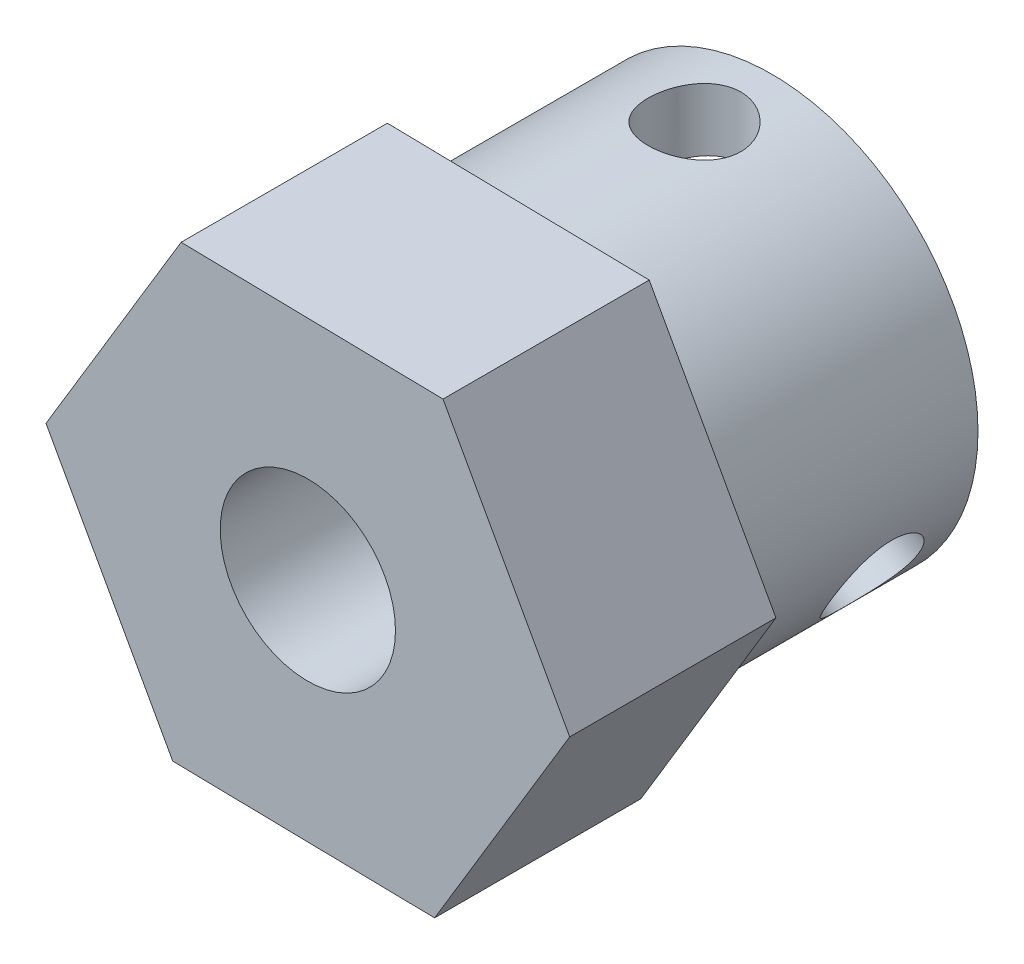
ISO-10303-21;
HEADER;
FILE_DESCRIPTION(('STEP AP214'),'2;1');
FILE_NAME('part.step','',(''),(''),'','','');
FILE_SCHEMA(('AUTOMOTIVE_DESIGN { 1 0 10303 214 1 1 1 1 }'));
ENDSEC;
DATA;
#1=APPLICATION_CONTEXT('core data for automotive mechanical design processes');
#2=APPLICATION_PROTOCOL_DEFINITION('international standard','automotive_design',2000,#1);
#3=PRODUCT_CONTEXT('',#1,'mechanical');
#4=PRODUCT('Part','Part','',(#3));
#5=PRODUCT_RELATED_PRODUCT_CATEGORY('part','',(#4));
#6=PRODUCT_DEFINITION_FORMATION('','',#4);
#7=PRODUCT_DEFINITION_CONTEXT('part definition',#1,'design');
#8=PRODUCT_DEFINITION('design','',#6,#7);
#9=PRODUCT_DEFINITION_SHAPE('','',#8);
#10=(LENGTH_UNIT() NAMED_UNIT(*) SI_UNIT(.MILLI.,.METRE.));
#11=(NAMED_UNIT(*) PLANE_ANGLE_UNIT() SI_UNIT($,.RADIAN.));
#12=(NAMED_UNIT(*) SI_UNIT($,.STERADIAN.) SOLID_ANGLE_UNIT());
#13=UNCERTAINTY_MEASURE_WITH_UNIT(LENGTH_MEASURE(1.E-05),#10,'distance_accuracy_value','');
#14=(GEOMETRIC_REPRESENTATION_CONTEXT(3) GLOBAL_UNCERTAINTY_ASSIGNED_CONTEXT((#13)) GLOBAL_UNIT_ASSIGNED_CONTEXT((#10,
#11,#12)) REPRESENTATION_CONTEXT('',''));
#15=CARTESIAN_POINT('',(0.,0.,0.));
#16=DIRECTION('',(0.,0.,1.));
#17=DIRECTION('',(1.,0.,0.));
#18=AXIS2_PLACEMENT_3D('',#15,#16,#17);
#19=CARTESIAN_POINT('',(0.,0.,-8.89));
#20=DIRECTION('',(0.,0.,1.));
#21=DIRECTION('',(1.,0.,0.));
#22=AXIS2_PLACEMENT_3D('',#19,#20,#21);
#23=CYLINDRICAL_SURFACE('',#22,5.08);
#24=CARTESIAN_POINT('',(3.7151027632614,-3.46473829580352,-6.985));
#25=CARTESIAN_POINT('',(3.71510492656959,-3.4647371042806,-6.92167529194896));
#26=CARTESIAN_POINT('',(3.71880684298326,-3.460779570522,-6.85832558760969));
#27=CARTESIAN_POINT('',(3.73340901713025,-3.44502080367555,-6.73343108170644));
#28=CARTESIAN_POINT('',(3.74431428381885,-3.43321411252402,-6.67188756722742));
#29=CARTESIAN_POINT('',(3.77269797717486,-3.40199815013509,-6.55243010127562));
#30=CARTESIAN_POINT('',(3.79016895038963,-3.38259749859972,-6.49451212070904));
#31=CARTESIAN_POINT('',(3.83077327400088,-3.33654229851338,-6.38378022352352));
#32=CARTESIAN_POINT('',(3.85390657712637,-3.30988781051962,-6.33096626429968));
#33=CARTESIAN_POINT('',(3.9051353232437,-3.24929423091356,-6.2309975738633));
#34=CARTESIAN_POINT('',(3.93330448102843,-3.21524503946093,-6.1839473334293));
#35=CARTESIAN_POINT('',(3.99305813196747,-3.14072661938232,-6.09775782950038));
#36=CARTESIAN_POINT('',(4.02464289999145,-3.10025687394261,-6.05861920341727));
#37=CARTESIAN_POINT('',(4.09024650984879,-3.01318488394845,-5.98894788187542));
#38=CARTESIAN_POINT('',(4.12428858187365,-2.96651924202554,-5.9585161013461));
#39=CARTESIAN_POINT('',(4.1930869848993,-2.86844979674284,-5.90777581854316));
#40=CARTESIAN_POINT('',(4.22784323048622,-2.81704655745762,-5.88746611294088));
#41=CARTESIAN_POINT('',(4.29616501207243,-2.71168608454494,-5.85787629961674));
#42=CARTESIAN_POINT('',(4.32974073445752,-2.65778519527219,-5.84841922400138));
#43=CARTESIAN_POINT('',(4.39515628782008,-2.54815102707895,-5.84024940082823));
#44=CARTESIAN_POINT('',(4.42699632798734,-2.49241797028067,-5.84153535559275));
#45=CARTESIAN_POINT('',(4.48747170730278,-2.38178564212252,-5.85468414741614));
#46=CARTESIAN_POINT('',(4.51615441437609,-2.32688941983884,-5.86635618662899));
#47=CARTESIAN_POINT('',(4.57034313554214,-2.21856570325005,-5.89964127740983));
#48=CARTESIAN_POINT('',(4.5958490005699,-2.16513827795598,-5.92125479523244));
#49=CARTESIAN_POINT('',(4.643499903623,-2.06097483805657,-5.97397529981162));
#50=CARTESIAN_POINT('',(4.66561769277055,-2.01026258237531,-6.00515375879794));
#51=CARTESIAN_POINT('',(4.70611414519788,-1.91354199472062,-6.07606564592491));
#52=CARTESIAN_POINT('',(4.72449227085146,-1.86753433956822,-6.11580030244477));
#53=CARTESIAN_POINT('',(4.75789566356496,-1.78074199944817,-6.20373247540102));
#54=CARTESIAN_POINT('',(4.77283826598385,-1.74009449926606,-6.25209695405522));
#55=CARTESIAN_POINT('',(4.79897437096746,-1.66666390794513,-6.35537238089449));
#56=CARTESIAN_POINT('',(4.81016775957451,-1.63388105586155,-6.41028352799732));
#57=CARTESIAN_POINT('',(4.82901089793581,-1.57732352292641,-6.52536286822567));
#58=CARTESIAN_POINT('',(4.83664888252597,-1.55357879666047,-6.58554774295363));
#59=CARTESIAN_POINT('',(4.84848519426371,-1.51623844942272,-6.70930732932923));
#60=CARTESIAN_POINT('',(4.85268410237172,-1.50264111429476,-6.77288146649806));
#61=CARTESIAN_POINT('',(4.85769246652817,-1.48636990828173,-6.90014751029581));
#62=CARTESIAN_POINT('',(4.85857299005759,-1.48346703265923,-6.96380737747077));
#63=CARTESIAN_POINT('',(4.85716352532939,-1.48807532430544,-7.09071001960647));
#64=CARTESIAN_POINT('',(4.85487376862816,-1.49558573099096,-7.15395282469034));
#65=CARTESIAN_POINT('',(4.84711761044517,-1.52053153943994,-7.27740166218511));
#66=CARTESIAN_POINT('',(4.84169180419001,-1.53784004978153,-7.33763600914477));
#67=CARTESIAN_POINT('',(4.82757731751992,-1.58158852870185,-7.45428350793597));
#68=CARTESIAN_POINT('',(4.81888830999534,-1.60802941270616,-7.51069627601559));
#69=CARTESIAN_POINT('',(4.79792313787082,-1.66955166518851,-7.6191072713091));
#70=CARTESIAN_POINT('',(4.78559109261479,-1.70476618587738,-7.67101908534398));
#71=CARTESIAN_POINT('',(4.75723638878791,-1.78235922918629,-7.76803942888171));
#72=CARTESIAN_POINT('',(4.74121324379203,-1.82473869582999,-7.81314706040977));
#73=CARTESIAN_POINT('',(4.70501875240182,-1.916157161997,-7.89619381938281));
#74=CARTESIAN_POINT('',(4.68477144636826,-1.96531155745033,-7.93397305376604));
#75=CARTESIAN_POINT('',(4.64036355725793,-2.06798203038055,-8.00014382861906));
#76=CARTESIAN_POINT('',(4.61620316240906,-2.12149789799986,-8.0285358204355));
#77=CARTESIAN_POINT('',(4.56438673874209,-2.23078532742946,-8.07490724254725));
#78=CARTESIAN_POINT('',(4.53675504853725,-2.2865395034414,-8.09295472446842));
#79=CARTESIAN_POINT('',(4.47838312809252,-2.3988509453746,-8.11833603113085));
#80=CARTESIAN_POINT('',(4.44764337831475,-2.45540808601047,-8.12567150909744));
#81=CARTESIAN_POINT('',(4.38455459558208,-2.56633273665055,-8.12934264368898));
#82=CARTESIAN_POINT('',(4.35225576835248,-2.620721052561,-8.1259164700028));
#83=CARTESIAN_POINT('',(4.28643028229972,-2.72705449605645,-8.10869672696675));
#84=CARTESIAN_POINT('',(4.25290364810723,-2.77899967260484,-8.09490336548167));
#85=CARTESIAN_POINT('',(4.18589951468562,-2.87893291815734,-8.0574576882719));
#86=CARTESIAN_POINT('',(4.1524222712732,-2.92693452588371,-8.03384095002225));
#87=CARTESIAN_POINT('',(4.08663115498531,-3.01811371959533,-7.97745293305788));
#88=CARTESIAN_POINT('',(4.05431740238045,-3.06129080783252,-7.94468071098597));
#89=CARTESIAN_POINT('',(3.99150027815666,-3.14277390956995,-7.87014496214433));
#90=CARTESIAN_POINT('',(3.96104591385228,-3.1809654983,-7.82821502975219));
#91=CARTESIAN_POINT('',(3.90398299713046,-3.25074657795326,-7.73688740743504));
#92=CARTESIAN_POINT('',(3.8773753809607,-3.28233446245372,-7.68748790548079));
#93=CARTESIAN_POINT('',(3.82891123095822,-3.33874906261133,-7.58177154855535));
#94=CARTESIAN_POINT('',(3.80712826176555,-3.36347237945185,-7.52536569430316));
#95=CARTESIAN_POINT('',(3.76996264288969,-3.40507941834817,-7.40779030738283));
#96=CARTESIAN_POINT('',(3.75457471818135,-3.42196960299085,-7.34662475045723));
#97=CARTESIAN_POINT('',(3.7336842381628,-3.44473230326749,-7.23535537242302));
#98=CARTESIAN_POINT('',(3.72673943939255,-3.45222532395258,-7.18584290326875));
#99=CARTESIAN_POINT('',(3.71744796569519,-3.46222865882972,-7.08589221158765));
#100=CARTESIAN_POINT('',(3.71510103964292,-3.46473924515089,-7.03545403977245));
#101=CARTESIAN_POINT('',(3.7151027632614,-3.46473829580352,-6.985));
#102=B_SPLINE_CURVE_WITH_KNOTS('',3,(#24,#25,#26,#27,#28,#29,#30,#31,#32,#33,#34,#35,#36,#37,
#38,#39,#40,#41,#42,#43,#44,#45,#46,#47,#48,#49,#50,#51,#52,#53,#54,#55,#56,#57,#58,#59,#60,#61,
#62,#63,#64,#65,#66,#67,#68,#69,#70,#71,#72,#73,#74,#75,#76,#77,#78,#79,#80,#81,#82,#83,#84,#85,
#86,#87,#88,#89,#90,#91,#92,#93,#94,#95,#96,#97,#98,#99,#100,#101),.UNSPECIFIED.,.T.,.F.,(4,2,2,
2,2,2,2,2,2,2,2,2,2,2,2,2,2,2,2,2,2,2,2,2,2,2,2,2,2,2,2,2,2,2,2,2,2,2,4),(0.,0.189789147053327,
0.379710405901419,0.569416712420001,0.759121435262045,0.951872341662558,1.14463877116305,
1.3395564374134,1.53445092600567,1.7261200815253,1.91776608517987,2.10596250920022,
2.29416776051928,2.48381508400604,2.67348965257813,2.8673373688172,3.0611909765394,
3.25568158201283,3.45013932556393,3.64040803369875,3.83066284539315,4.01850833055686,
4.2063726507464,4.39728316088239,4.58821884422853,4.78294086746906,4.97765352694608,
5.17107011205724,5.36445684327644,5.55359406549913,5.74272749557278,5.93118182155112,
6.11965557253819,6.31189115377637,6.50417344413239,6.69921175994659,6.89408887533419,
7.04531187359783,7.19652661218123),.UNSPECIFIED.);
#103=CARTESIAN_POINT('',(3.7151027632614,-3.46473829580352,-6.985));
#104=VERTEX_POINT('',#103);
#105=EDGE_CURVE('E212',#104,#104,#102,.T.);
#106=ORIENTED_EDGE('',*,*,#105,.T.);
#107=EDGE_LOOP('',(#106));
#108=FACE_BOUND('',#107,.T.);
#109=CARTESIAN_POINT('',(0.,0.,-2.54));
#110=DIRECTION('',(0.,0.,1.));
#111=DIRECTION('',(1.,0.,0.));
#112=AXIS2_PLACEMENT_3D('',#109,#110,#111);
#113=CIRCLE('',#112,5.08);
#114=CARTESIAN_POINT('',(5.08,0.,-2.54));
#115=VERTEX_POINT('',#114);
#116=EDGE_CURVE('E46',#115,#115,#113,.F.);
#117=ORIENTED_EDGE('',*,*,#116,.T.);
#118=EDGE_LOOP('',(#117));
#119=FACE_BOUND('',#118,.T.);
#120=CARTESIAN_POINT('',(0.,0.,-8.89));
#121=DIRECTION('',(0.,0.,1.));
#122=DIRECTION('',(1.,0.,0.));
#123=AXIS2_PLACEMENT_3D('',#120,#121,#122);
#124=CIRCLE('',#123,5.08);
#125=CARTESIAN_POINT('',(5.08,0.,-8.89));
#126=VERTEX_POINT('',#125);
#127=EDGE_CURVE('E11',#126,#126,#124,.T.);
#128=ORIENTED_EDGE('',*,*,#127,.T.);
#129=EDGE_LOOP('',(#128));
#130=FACE_BOUND('',#129,.T.);
#131=CARTESIAN_POINT('',(0.,5.08,-8.128));
#132=CARTESIAN_POINT('',(0.0633475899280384,5.07999884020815,-8.12799790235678));
#133=CARTESIAN_POINT('',(0.126720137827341,5.0788030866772,-8.12271593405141));
#134=CARTESIAN_POINT('',(0.251662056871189,5.07414854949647,-8.10175139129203));
#135=CARTESIAN_POINT('',(0.313230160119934,5.07068821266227,-8.0860616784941));
#136=CARTESIAN_POINT('',(0.4327397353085,5.06188939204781,-8.04480039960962));
#137=CARTESIAN_POINT('',(0.490685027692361,5.05655292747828,-8.01923945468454));
#138=CARTESIAN_POINT('',(0.601463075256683,5.04457634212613,-7.9589957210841));
#139=CARTESIAN_POINT('',(0.65429590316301,5.0379362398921,-7.92431306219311));
#140=CARTESIAN_POINT('',(0.754244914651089,5.02395291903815,-7.84618955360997));
#141=CARTESIAN_POINT('',(0.801262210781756,5.01660056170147,-7.80262381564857));
#142=CARTESIAN_POINT('',(0.887387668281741,5.00208506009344,-7.70823879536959));
#143=CARTESIAN_POINT('',(0.926495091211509,4.99492193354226,-7.65741883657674));
#144=CARTESIAN_POINT('',(0.996132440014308,4.9815054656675,-7.54922982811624));
#145=CARTESIAN_POINT('',(1.02655607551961,4.97526381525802,-7.49179078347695));
#146=CARTESIAN_POINT('',(1.07728011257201,4.96452860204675,-7.37245151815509));
#147=CARTESIAN_POINT('',(1.09758180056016,4.96003481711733,-7.31055186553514));
#148=CARTESIAN_POINT('',(1.1271568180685,4.95339738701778,-7.18512409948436));
#149=CARTESIAN_POINT('',(1.13660576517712,4.9512163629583,-7.12163941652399));
#150=CARTESIAN_POINT('',(1.14475333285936,4.94933921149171,-6.99395133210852));
#151=CARTESIAN_POINT('',(1.14345335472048,4.94964276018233,-6.92974802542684));
#152=CARTESIAN_POINT('',(1.13028106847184,4.95266666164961,-6.80375829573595));
#153=CARTESIAN_POINT('',(1.11861375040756,4.95534015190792,-6.74194914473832));
#154=CARTESIAN_POINT('',(1.08536316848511,4.96272849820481,-6.62118864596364));
#155=CARTESIAN_POINT('',(1.06377931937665,4.96744347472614,-6.56223746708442));
#156=CARTESIAN_POINT('',(1.01112275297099,4.97842910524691,-6.44829514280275));
#157=CARTESIAN_POINT('',(0.979972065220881,4.98471245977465,-6.39334130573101));
#158=CARTESIAN_POINT('',(0.909120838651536,4.99811920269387,-6.28936540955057));
#159=CARTESIAN_POINT('',(0.869419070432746,5.00524271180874,-6.2403442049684));
#160=CARTESIAN_POINT('',(0.781511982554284,5.01972748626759,-6.14844590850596));
#161=CARTESIAN_POINT('',(0.733132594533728,5.02709045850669,-6.10573542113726));
#162=CARTESIAN_POINT('',(0.629813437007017,5.04107611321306,-6.02900598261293));
#163=CARTESIAN_POINT('',(0.574873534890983,5.04769878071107,-5.99498720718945));
#164=CARTESIAN_POINT('',(0.459783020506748,5.05948113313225,-5.93656195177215));
#165=CARTESIAN_POINT('',(0.399620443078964,5.06463733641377,-5.91217829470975));
#166=CARTESIAN_POINT('',(0.275909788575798,5.0728800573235,-5.87391353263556));
#167=CARTESIAN_POINT('',(0.212362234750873,5.07596689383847,-5.860030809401));
#168=CARTESIAN_POINT('',(0.08511369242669,5.07967734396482,-5.84340661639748));
#169=CARTESIAN_POINT('',(0.0214438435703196,5.08035123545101,-5.84043770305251));
#170=CARTESIAN_POINT('',(-0.105482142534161,5.0793011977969,-5.84510753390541));
#171=CARTESIAN_POINT('',(-0.168738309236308,5.07757744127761,-5.85274551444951));
#172=CARTESIAN_POINT('',(-0.292280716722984,5.071957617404,-5.87822389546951));
#173=CARTESIAN_POINT('',(-0.352593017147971,5.06808715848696,-5.89594408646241));
#174=CARTESIAN_POINT('',(-0.469388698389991,5.05860756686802,-5.94094971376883));
#175=CARTESIAN_POINT('',(-0.525871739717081,5.05299828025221,-5.9682359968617));
#176=CARTESIAN_POINT('',(-0.634339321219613,5.0405398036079,-6.03206677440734));
#177=CARTESIAN_POINT('',(-0.686243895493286,5.03367331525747,-6.0687437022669));
#178=CARTESIAN_POINT('',(-0.783243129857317,5.01949573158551,-6.15014125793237));
#179=CARTESIAN_POINT('',(-0.828336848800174,5.01218457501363,-6.19486299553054));
#180=CARTESIAN_POINT('',(-0.911340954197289,4.99776657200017,-6.29212700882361));
#181=CARTESIAN_POINT('',(-0.949093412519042,4.99066652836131,-6.34480525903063));
#182=CARTESIAN_POINT('',(-1.01521721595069,4.97763742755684,-6.45588735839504));
#183=CARTESIAN_POINT('',(-1.04358897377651,4.97170831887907,-6.51429095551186));
#184=CARTESIAN_POINT('',(-1.08994921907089,4.96175103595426,-6.63484917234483));
#185=CARTESIAN_POINT('',(-1.1079972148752,4.95771199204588,-6.69697996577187));
#186=CARTESIAN_POINT('',(-1.13336929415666,4.95197398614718,-6.82349564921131));
#187=CARTESIAN_POINT('',(-1.14069520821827,4.95027462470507,-6.88788015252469));
#188=CARTESIAN_POINT('',(-1.14433376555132,4.94943459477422,-7.01548066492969));
#189=CARTESIAN_POINT('',(-1.14089715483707,4.95023566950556,-7.07868926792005));
#190=CARTESIAN_POINT('',(-1.12367131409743,4.95417393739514,-7.20360170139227));
#191=CARTESIAN_POINT('',(-1.10988222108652,4.95731109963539,-7.26530555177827));
#192=CARTESIAN_POINT('',(-1.07246713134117,4.96553886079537,-7.38524375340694));
#193=CARTESIAN_POINT('',(-1.0488796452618,4.97062180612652,-7.44349067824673));
#194=CARTESIAN_POINT('',(-0.992569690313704,4.98217099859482,-7.55523698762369));
#195=CARTESIAN_POINT('',(-0.959846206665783,4.98863739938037,-7.60873584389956));
#196=CARTESIAN_POINT('',(-0.885370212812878,5.00239742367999,-7.71069890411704));
#197=CARTESIAN_POINT('',(-0.843439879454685,5.00970575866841,-7.75903126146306));
#198=CARTESIAN_POINT('',(-0.752098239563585,5.02422956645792,-7.84805581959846));
#199=CARTESIAN_POINT('',(-0.702685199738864,5.0314450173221,-7.88874624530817));
#200=CARTESIAN_POINT('',(-0.596952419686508,5.0450892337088,-7.96187568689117));
#201=CARTESIAN_POINT('',(-0.540546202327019,5.05150566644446,-7.994192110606));
#202=CARTESIAN_POINT('',(-0.422968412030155,5.06270412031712,-8.04883360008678));
#203=CARTESIAN_POINT('',(-0.361800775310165,5.06748747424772,-8.0711668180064));
#204=CARTESIAN_POINT('',(-0.250501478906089,5.0740547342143,-8.10135227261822));
#205=CARTESIAN_POINT('',(-0.200959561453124,5.07627012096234,-8.11132564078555));
#206=CARTESIAN_POINT('',(-0.100950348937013,5.07924318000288,-8.12465017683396));
#207=CARTESIAN_POINT('',(-0.0504830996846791,5.08000092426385,-8.12800167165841));
#208=CARTESIAN_POINT('',(0.,5.08,-8.128));
#209=B_SPLINE_CURVE_WITH_KNOTS('',3,(#131,#132,#133,#134,#135,#136,#137,#138,#139,#140,#141,
#142,#143,#144,#145,#146,#147,#148,#149,#150,#151,#152,#153,#154,#155,#156,#157,#158,#159,#160,
#161,#162,#163,#164,#165,#166,#167,#168,#169,#170,#171,#172,#173,#174,#175,#176,#177,#178,#179,
#180,#181,#182,#183,#184,#185,#186,#187,#188,#189,#190,#191,#192,#193,#194,#195,#196,#197,#198,
#199,#200,#201,#202,#203,#204,#205,#206,#207,#208),.UNSPECIFIED.,.T.,.F.,(4,2,2,2,2,2,2,2,2,2,2,
2,2,2,2,2,2,2,2,2,2,2,2,2,2,2,2,2,2,2,2,2,2,2,2,2,2,2,4),(0.,0.189857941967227,
0.379846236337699,0.569630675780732,0.759412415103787,0.952073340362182,1.14475224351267,
1.33969726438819,1.534617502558,1.72633704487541,1.91803159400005,2.10601813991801,
2.29401578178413,2.48358821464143,2.67318792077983,2.86713391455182,3.06108382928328,
3.25549044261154,3.4498670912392,3.64016920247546,3.83045761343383,4.018523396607,
4.20660583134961,4.39750280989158,4.58842614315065,4.7830875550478,4.97774040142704,
5.17125961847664,5.36474579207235,5.55375792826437,5.74276756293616,5.93104125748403,
6.11933587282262,6.31164982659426,6.50400839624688,6.69904148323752,6.89391501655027,
7.04522449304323,7.19652649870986),.UNSPECIFIED.);
#210=CARTESIAN_POINT('',(0.,5.08,-8.128));
#211=VERTEX_POINT('',#210);
#212=EDGE_CURVE('E159',#211,#211,#209,.T.);
#213=ORIENTED_EDGE('',*,*,#212,.T.);
#214=EDGE_LOOP('',(#213));
#215=FACE_BOUND('',#214,.T.);
#216=CARTESIAN_POINT('',(-4.85810276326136,-1.48500422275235,-6.985));
#217=CARTESIAN_POINT('',(-4.85810281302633,-1.48500669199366,-6.92167529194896));
#218=CARTESIAN_POINT('',(-4.85652644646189,-1.49019141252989,-6.85832558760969));
#219=CARTESIAN_POINT('',(-4.85018004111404,-1.51071664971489,-6.73343108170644));
#220=CARTESIAN_POINT('',(-4.84540777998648,-1.52606423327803,-6.67188756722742));
#221=CARTESIAN_POINT('',(-4.83256581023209,-1.56625321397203,-6.55243010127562));
#222=CARTESIAN_POINT('',(-4.82449983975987,-1.59108384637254,-6.49451212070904));
#223=CARTESIAN_POINT('',(-4.80491702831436,-1.64927582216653,-6.38378022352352));
#224=CARTESIAN_POINT('',(-4.79340021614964,-1.68263709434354,-6.33096626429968));
#225=CARTESIAN_POINT('',(-4.76653900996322,-1.7572992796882,-6.2309975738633));
#226=CARTESIAN_POINT('',(-4.75113612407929,-1.7987190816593,-6.1839473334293));
#227=CARTESIAN_POINT('',(-4.71647810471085,-1.88772647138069,-6.09775782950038));
#228=CARTESIAN_POINT('',(-4.69722266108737,-1.93531455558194,-6.05861920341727));
#229=CARTESIAN_POINT('',(-4.65461791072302,-2.03566494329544,-5.98894788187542));
#230=CARTESIAN_POINT('',(-4.63122531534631,-2.08847906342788,-5.9585161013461));
#231=CARTESIAN_POINT('',(-4.58069388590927,-2.19709495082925,-5.90777581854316));
#232=CARTESIAN_POINT('',(-4.55355549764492,-2.25289636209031,-5.88746611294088));
#233=CARTESIAN_POINT('',(-4.4964715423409,-2.36474499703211,-5.85787629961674));
#234=CARTESIAN_POINT('',(-4.46657986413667,-2.42077287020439,-5.84841922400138));
#235=CARTESIAN_POINT('',(-4.40434166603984,-2.53224148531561,-5.84024940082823));
#236=CARTESIAN_POINT('',(-4.37199544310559,-2.5876822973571,-5.84153535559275));
#237=CARTESIAN_POINT('',(-4.30642272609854,-2.69537167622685,-5.85468414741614));
#238=CARTESIAN_POINT('',(-4.27322255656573,-2.74765974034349,-5.86635618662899));
#239=CARTESIAN_POINT('',(-4.20650582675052,-2.84875040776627,-5.89964127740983));
#240=CARTESIAN_POINT('',(-4.17298925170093,-2.89755284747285,-5.92125479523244));
#241=CARTESIAN_POINT('',(-4.10660651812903,-2.99090145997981,-5.97397529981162));
#242=CARTESIAN_POINT('',(-4.07374731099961,-3.03541215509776,-6.00515375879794));
#243=CARTESIAN_POINT('',(-4.01023305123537,-3.11884340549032,-6.07606564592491));
#244=CARTESIAN_POINT('',(-3.97957831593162,-3.15776315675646,-6.11580030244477));
#245=CARTESIAN_POINT('',(-3.9211156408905,-3.23008751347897,-6.20373247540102));
#246=CARTESIAN_POINT('',(-3.89338517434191,-3.26335193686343,-6.25209695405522));
#247=CARTESIAN_POINT('',(-3.84286046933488,-3.32270176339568,-6.35537238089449));
#248=CARTESIAN_POINT('',(-3.82006638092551,-3.34878694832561,-6.41028352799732));
#249=CARTESIAN_POINT('',(-3.78050768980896,-3.3933843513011,-6.52536286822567));
#250=CARTESIAN_POINT('',(-3.76376314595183,-3.41187140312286,-6.58554774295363));
#251=CARTESIAN_POINT('',(-3.73734361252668,-3.44079212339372,-6.70930732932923));
#252=CARTESIAN_POINT('',(-3.72766742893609,-3.4512271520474,-6.77288146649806));
#253=CARTESIAN_POINT('',(-3.71608033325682,-3.4637001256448,-6.90014751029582));
#254=CARTESIAN_POINT('',(-3.71400663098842,-3.46591411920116,-6.96380737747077));
#255=CARTESIAN_POINT('',(-3.71729279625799,-3.4623893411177,-7.09071001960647));
#256=CARTESIAN_POINT('',(-3.72265212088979,-3.45665115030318,-7.15395282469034));
#257=CARTESIAN_POINT('',(-3.74037774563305,-3.43746121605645,-7.27740166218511));
#258=CARTESIAN_POINT('',(-3.75265445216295,-3.42410807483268,-7.33763600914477));
#259=CARTESIAN_POINT('',(-3.78348450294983,-3.39001033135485,-7.45428350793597));
#260=CARTESIAN_POINT('',(-3.80203847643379,-3.36926498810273,-7.51069627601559));
#261=CARTESIAN_POINT('',(-3.84483572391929,-3.32034749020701,-7.6191072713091));
#262=CARTESIAN_POINT('',(-3.86916637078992,-3.29206036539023,-7.67101908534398));
#263=CARTESIAN_POINT('',(-3.92218656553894,-3.22870794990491,-7.76803942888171));
#264=CARTESIAN_POINT('',(-3.95087668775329,-3.1936417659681,-7.81314706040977));
#265=CARTESIAN_POINT('',(-4.01195015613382,-3.11658718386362,-7.89619381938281));
#266=CARTESIAN_POINT('',(-4.04439545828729,-3.0744753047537,-7.93397305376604));
#267=CARTESIAN_POINT('',(-4.11110675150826,-2.9846817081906,-8.00014382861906));
#268=CARTESIAN_POINT('',(-4.14537265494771,-2.93700025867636,-8.0285358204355));
#269=CARTESIAN_POINT('',(-4.21411013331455,-2.8374822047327,-8.07490724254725));
#270=CARTESIAN_POINT('',(-4.24857882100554,-2.78567537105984,-8.09295472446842));
#271=CARTESIAN_POINT('',(-4.31665742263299,-2.67896808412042,-8.11833603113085));
#272=CARTESIAN_POINT('',(-4.35026746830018,-2.62406810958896,-8.12567150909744));
#273=CARTESIAN_POINT('',(-4.41478664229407,-2.51396929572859,-8.12934264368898));
#274=CARTESIAN_POINT('',(-4.44573889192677,-2.45880353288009,-8.1259164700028));
#275=CARTESIAN_POINT('',(-4.50491361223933,-2.34863026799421,-8.10869672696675));
#276=CARTESIAN_POINT('',(-4.53313613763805,-2.29362276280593,-8.09490336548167));
#277=CARTESIAN_POINT('',(-4.58617880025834,-2.18562885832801,-8.0574576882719));
#278=CARTESIAN_POINT('',(-4.61101079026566,-2.13263591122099,-8.03384095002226));
#279=CARTESIAN_POINT('',(-4.65707873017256,-2.03006953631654,-7.97745293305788));
#280=CARTESIAN_POINT('',(-4.67831430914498,-1.98049646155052,-7.94468071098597));
#281=CARTESIAN_POINT('',(-4.71747218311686,-1.88535368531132,-7.87014496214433));
#282=CARTESIAN_POINT('',(-4.73531988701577,-1.8398836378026,-7.82821502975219));
#283=CARTESIAN_POINT('',(-4.76722061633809,-1.75557516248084,-7.73688740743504));
#284=CARTESIAN_POINT('',(-4.78127271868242,-1.71673834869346,-7.68748790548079));
#285=CARTESIAN_POINT('',(-4.80589712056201,-1.64655986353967,-7.58177154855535));
#286=CARTESIAN_POINT('',(-4.81641665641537,-1.61533360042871,-7.52536569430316));
#287=CARTESIAN_POINT('',(-4.83386659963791,-1.56234371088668,-7.40779030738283));
#288=CARTESIAN_POINT('',(-4.84079996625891,-1.5405722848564,-7.34662475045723));
#289=CARTESIAN_POINT('',(-4.85006780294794,-1.51109924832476,-7.23535537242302));
#290=CARTESIAN_POINT('',(-4.85308454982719,-1.50133836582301,-7.18584290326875));
#291=CARTESIAN_POINT('',(-4.85710195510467,-1.48829004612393,-7.08589221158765));
#292=CARTESIAN_POINT('',(-4.85810272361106,-1.48500225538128,-7.03545403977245));
#293=CARTESIAN_POINT('',(-4.85810276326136,-1.48500422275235,-6.985));
#294=B_SPLINE_CURVE_WITH_KNOTS('',3,(#216,#217,#218,#219,#220,#221,#222,#223,#224,#225,#226,
#227,#228,#229,#230,#231,#232,#233,#234,#235,#236,#237,#238,#239,#240,#241,#242,#243,#244,#245,
#246,#247,#248,#249,#250,#251,#252,#253,#254,#255,#256,#257,#258,#259,#260,#261,#262,#263,#264,
#265,#266,#267,#268,#269,#270,#271,#272,#273,#274,#275,#276,#277,#278,#279,#280,#281,#282,#283,
#284,#285,#286,#287,#288,#289,#290,#291,#292,#293),.UNSPECIFIED.,.T.,.F.,(4,2,2,2,2,2,2,2,2,2,2,
2,2,2,2,2,2,2,2,2,2,2,2,2,2,2,2,2,2,2,2,2,2,2,2,2,2,2,4),(0.,0.189789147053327,
0.379710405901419,0.569416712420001,0.759121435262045,0.951872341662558,1.14463877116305,
1.3395564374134,1.53445092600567,1.7261200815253,1.91776608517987,2.10596250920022,
2.29416776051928,2.48381508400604,2.67348965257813,2.8673373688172,3.0611909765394,
3.25568158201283,3.45013932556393,3.64040803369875,3.83066284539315,4.01850833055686,
4.2063726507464,4.39728316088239,4.58821884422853,4.78294086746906,4.97765352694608,
5.17107011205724,5.36445684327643,5.55359406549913,5.74272749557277,5.93118182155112,
6.11965557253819,6.31189115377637,6.50417344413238,6.69921175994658,6.89408887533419,
7.04531187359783,7.19652661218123),.UNSPECIFIED.);
#295=CARTESIAN_POINT('',(-4.85810276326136,-1.48500422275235,-6.985));
#296=VERTEX_POINT('',#295);
#297=EDGE_CURVE('E160',#296,#296,#294,.T.);
#298=ORIENTED_EDGE('',*,*,#297,.T.);
#299=EDGE_LOOP('',(#298));
#300=FACE_BOUND('',#299,.T.);
#301=ADVANCED_FACE('F33',(#108,#119,#130,#215,#300),#23,.T.);
#302=CARTESIAN_POINT('',(0.,0.,-1.016));
#303=DIRECTION('',(0.,0.,-1.));
#304=DIRECTION('',(-1.,0.,0.));
#305=AXIS2_PLACEMENT_3D('',#302,#303,#304);
#306=CYLINDRICAL_SURFACE('',#305,3.556);
#307=CARTESIAN_POINT('',(0.,0.,-1.016));
#308=DIRECTION('',(0.,0.,-1.));
#309=DIRECTION('',(-1.,0.,0.));
#310=AXIS2_PLACEMENT_3D('',#307,#308,#309);
#311=CIRCLE('',#310,3.556);
#312=CARTESIAN_POINT('',(-3.556,0.,-1.016));
#313=VERTEX_POINT('',#312);
#314=EDGE_CURVE('E115',#313,#313,#311,.T.);
#315=ORIENTED_EDGE('',*,*,#314,.F.);
#316=EDGE_LOOP('',(#315));
#317=FACE_BOUND('',#316,.T.);
#318=CARTESIAN_POINT('',(0.,0.,-8.89));
#319=DIRECTION('',(0.,0.,-1.));
#320=DIRECTION('',(-1.,0.,0.));
#321=AXIS2_PLACEMENT_3D('',#318,#319,#320);
#322=CIRCLE('',#321,3.556);
#323=CARTESIAN_POINT('',(-3.556,0.,-8.89));
#324=VERTEX_POINT('',#323);
#325=EDGE_CURVE('E118',#324,#324,#322,.T.);
#326=ORIENTED_EDGE('',*,*,#325,.T.);
#327=EDGE_LOOP('',(#326));
#328=FACE_BOUND('',#327,.T.);
#329=CARTESIAN_POINT('',(0.,3.556,-8.128));
#330=CARTESIAN_POINT('',(0.0624901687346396,3.55599987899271,-8.12799987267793));
#331=CARTESIAN_POINT('',(0.12498208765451,3.55433737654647,-8.12285849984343));
#332=CARTESIAN_POINT('',(0.248132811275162,3.54786856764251,-8.1024865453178));
#333=CARTESIAN_POINT('',(0.308791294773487,3.54306171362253,-8.08725420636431));
#334=CARTESIAN_POINT('',(0.426481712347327,3.53082813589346,-8.04727105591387));
#335=CARTESIAN_POINT('',(0.483519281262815,3.52340560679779,-8.02253547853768));
#336=CARTESIAN_POINT('',(0.592636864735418,3.50670335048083,-7.96431452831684));
#337=CARTESIAN_POINT('',(0.644716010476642,3.49742329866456,-7.93082762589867));
#338=CARTESIAN_POINT('',(0.744129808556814,3.47765043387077,-7.85491094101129));
#339=CARTESIAN_POINT('',(0.791280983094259,3.46713007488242,-7.81224810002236));
#340=CARTESIAN_POINT('',(0.877897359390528,3.44621843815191,-7.71968648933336));
#341=CARTESIAN_POINT('',(0.917361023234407,3.43582718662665,-7.6697862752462));
#342=CARTESIAN_POINT('',(0.988498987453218,3.41605158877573,-7.56255137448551));
#343=CARTESIAN_POINT('',(1.01994017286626,3.40670106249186,-7.50505521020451));
#344=CARTESIAN_POINT('',(1.07262970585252,3.39048183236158,-7.38524218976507));
#345=CARTESIAN_POINT('',(1.09388091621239,3.38361243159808,-7.32292669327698));
#346=CARTESIAN_POINT('',(1.12490873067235,3.37342216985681,-7.19732130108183));
#347=CARTESIAN_POINT('',(1.13502716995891,3.36999589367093,-7.13412464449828));
#348=CARTESIAN_POINT('',(1.14457047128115,3.36676731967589,-7.00684493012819));
#349=CARTESIAN_POINT('',(1.14399836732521,3.36696399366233,-6.94276212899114));
#350=CARTESIAN_POINT('',(1.13244335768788,3.37086633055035,-6.81839325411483));
#351=CARTESIAN_POINT('',(1.12189978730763,3.37442390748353,-6.75806092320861));
#352=CARTESIAN_POINT('',(1.09141530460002,3.38440589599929,-6.64007169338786));
#353=CARTESIAN_POINT('',(1.07147334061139,3.39083062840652,-6.58241509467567));
#354=CARTESIAN_POINT('',(1.02245753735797,3.40593312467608,-6.47038788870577));
#355=CARTESIAN_POINT('',(0.993249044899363,3.41464376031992,-6.41608081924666));
#356=CARTESIAN_POINT('',(0.92662279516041,3.43332207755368,-6.31299689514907));
#357=CARTESIAN_POINT('',(0.889202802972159,3.44329010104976,-6.26422155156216));
#358=CARTESIAN_POINT('',(0.80507922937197,3.46394930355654,-6.17110810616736));
#359=CARTESIAN_POINT('',(0.758014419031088,3.47465215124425,-6.12709831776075));
#360=CARTESIAN_POINT('',(0.657039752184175,3.495151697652,-6.04751378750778));
#361=CARTESIAN_POINT('',(0.603129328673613,3.50494832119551,-6.01193974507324));
#362=CARTESIAN_POINT('',(0.489334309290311,3.52264496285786,-5.94999664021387));
#363=CARTESIAN_POINT('',(0.429402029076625,3.53052782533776,-5.92370994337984));
#364=CARTESIAN_POINT('',(0.305653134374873,3.54338466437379,-5.88169080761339));
#365=CARTESIAN_POINT('',(0.241837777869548,3.54835957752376,-5.86595497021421));
#366=CARTESIAN_POINT('',(0.114917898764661,3.55468739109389,-5.84605290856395));
#367=CARTESIAN_POINT('',(0.0518898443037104,3.55617924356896,-5.84144258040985));
#368=CARTESIAN_POINT('',(-0.0740483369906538,3.55578623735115,-5.84266481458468));
#369=CARTESIAN_POINT('',(-0.136958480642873,3.55390190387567,-5.84849575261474));
#370=CARTESIAN_POINT('',(-0.259134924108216,3.54705975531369,-5.87008054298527));
#371=CARTESIAN_POINT('',(-0.318453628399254,3.54218493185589,-5.88556663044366));
#372=CARTESIAN_POINT('',(-0.433631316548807,3.5299372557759,-5.92569201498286));
#373=CARTESIAN_POINT('',(-0.489489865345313,3.52256408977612,-5.95033246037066));
#374=CARTESIAN_POINT('',(-0.597730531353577,3.50584240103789,-6.00875973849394));
#375=CARTESIAN_POINT('',(-0.649989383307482,3.49644873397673,-6.04276164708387));
#376=CARTESIAN_POINT('',(-0.748206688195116,3.47675653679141,-6.11869093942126));
#377=CARTESIAN_POINT('',(-0.794163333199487,3.46645774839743,-6.16062058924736));
#378=CARTESIAN_POINT('',(-0.88048090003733,3.4455690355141,-6.25330440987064));
#379=CARTESIAN_POINT('',(-0.920525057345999,3.43498509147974,-6.30435562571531));
#380=CARTESIAN_POINT('',(-0.991511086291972,3.41517270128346,-6.41268236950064));
#381=CARTESIAN_POINT('',(-1.02245301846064,3.40594424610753,-6.46995785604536));
#382=CARTESIAN_POINT('',(-1.07418223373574,3.3899857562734,-6.58904451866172));
#383=CARTESIAN_POINT('',(-1.09500167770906,3.38324782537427,-6.65084060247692));
#384=CARTESIAN_POINT('',(-1.12585656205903,3.37310716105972,-6.77732484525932));
#385=CARTESIAN_POINT('',(-1.13589641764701,3.36970306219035,-6.84201180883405));
#386=CARTESIAN_POINT('',(-1.14457825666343,3.3667633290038,-6.96911449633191));
#387=CARTESIAN_POINT('',(-1.14374241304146,3.36705046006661,-7.03149087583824));
#388=CARTESIAN_POINT('',(-1.13196749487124,3.37102704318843,-7.15516649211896));
#389=CARTESIAN_POINT('',(-1.12102894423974,3.37471631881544,-7.21646578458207));
#390=CARTESIAN_POINT('',(-1.08971736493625,3.38495415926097,-7.33525383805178));
#391=CARTESIAN_POINT('',(-1.06950202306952,3.39145483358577,-7.39278860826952));
#392=CARTESIAN_POINT('',(-1.0203362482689,3.40656840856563,-7.5036950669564));
#393=CARTESIAN_POINT('',(-0.991383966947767,3.41518175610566,-7.55706587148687));
#394=CARTESIAN_POINT('',(-0.924177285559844,3.43399124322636,-7.66050265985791));
#395=CARTESIAN_POINT('',(-0.885589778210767,3.44423784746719,-7.71034299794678));
#396=CARTESIAN_POINT('',(-0.800784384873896,3.46493621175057,-7.80300990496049));
#397=CARTESIAN_POINT('',(-0.754564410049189,3.47538802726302,-7.84583454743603));
#398=CARTESIAN_POINT('',(-0.653846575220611,3.4957614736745,-7.92477071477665));
#399=CARTESIAN_POINT('',(-0.599114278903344,3.50565141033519,-7.96059225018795));
#400=CARTESIAN_POINT('',(-0.48408841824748,3.52337525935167,-8.02248199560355));
#401=CARTESIAN_POINT('',(-0.423796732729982,3.53120986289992,-8.0485534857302));
#402=CARTESIAN_POINT('',(-0.30358034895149,3.5434975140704,-8.08864245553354));
#403=CARTESIAN_POINT('',(-0.243907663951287,3.54814374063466,-8.10335707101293));
#404=CARTESIAN_POINT('',(-0.122823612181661,3.55439469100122,-8.12303477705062));
#405=CARTESIAN_POINT('',(-0.0614126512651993,3.55600011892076,-8.12800012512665));
#406=CARTESIAN_POINT('',(0.,3.556,-8.128));
#407=B_SPLINE_CURVE_WITH_KNOTS('',3,(#329,#330,#331,#332,#333,#334,#335,#336,#337,#338,#339,
#340,#341,#342,#343,#344,#345,#346,#347,#348,#349,#350,#351,#352,#353,#354,#355,#356,#357,#358,
#359,#360,#361,#362,#363,#364,#365,#366,#367,#368,#369,#370,#371,#372,#373,#374,#375,#376,#377,
#378,#379,#380,#381,#382,#383,#384,#385,#386,#387,#388,#389,#390,#391,#392,#393,#394,#395,#396,
#397,#398,#399,#400,#401,#402,#403,#404,#405,#406),.UNSPECIFIED.,.T.,.F.,(4,2,2,2,2,2,2,2,2,2,2,
2,2,2,2,2,2,2,2,2,2,2,2,2,2,2,2,2,2,2,2,2,2,2,2,2,2,2,4),(0.,0.187244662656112,
0.374521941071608,0.561500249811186,0.74851126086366,0.940995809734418,1.13351882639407,
1.33112388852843,1.52867340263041,1.71997141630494,1.91121513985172,2.09440701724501,
2.27761939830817,2.46362640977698,2.64968410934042,2.84473260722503,3.03979727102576,
3.23655084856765,3.43324102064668,3.62193953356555,3.81060869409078,3.99426497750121,
4.17794430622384,4.36625780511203,4.55462521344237,4.75091752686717,4.94720853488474,
5.14287175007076,5.33845479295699,5.52468345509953,5.71090246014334,5.89406710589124,
6.07727052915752,6.26799558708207,6.45877292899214,6.65627791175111,6.85371638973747,
7.03777501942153,7.22179102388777),.UNSPECIFIED.);
#408=CARTESIAN_POINT('',(0.,3.556,-8.128));
#409=VERTEX_POINT('',#408);
#410=EDGE_CURVE('E154',#409,#409,#407,.T.);
#411=ORIENTED_EDGE('',*,*,#410,.F.);
#412=EDGE_LOOP('',(#411));
#413=FACE_BOUND('',#412,.T.);
#414=CARTESIAN_POINT('',(2.3446644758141,-2.67351538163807,-6.985));
#415=CARTESIAN_POINT('',(2.34466467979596,-2.67351534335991,-6.92260403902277));
#416=CARTESIAN_POINT('',(2.34874613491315,-2.66995226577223,-6.86020632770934));
#417=CARTESIAN_POINT('',(2.3647798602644,-2.65576052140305,-6.73725058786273));
#418=CARTESIAN_POINT('',(2.37673389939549,-2.64513026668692,-6.67669297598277));
#419=CARTESIAN_POINT('',(2.40767811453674,-2.61699342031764,-6.55921709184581));
#420=CARTESIAN_POINT('',(2.42665527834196,-2.59949954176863,-6.50229231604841));
#421=CARTESIAN_POINT('',(2.47051032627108,-2.55785569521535,-6.39336736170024));
#422=CARTESIAN_POINT('',(2.49538936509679,-2.53370442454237,-6.34136814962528));
#423=CARTESIAN_POINT('',(2.55063451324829,-2.47810047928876,-6.24187983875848));
#424=CARTESIAN_POINT('',(2.58115454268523,-2.4464332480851,-6.19459607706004));
#425=CARTESIAN_POINT('',(2.64556971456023,-2.37662569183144,-6.10771939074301));
#426=CARTESIAN_POINT('',(2.67946535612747,-2.33848440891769,-6.06812760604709));
#427=CARTESIAN_POINT('',(2.74992126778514,-2.25524026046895,-5.99684188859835));
#428=CARTESIAN_POINT('',(2.78652603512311,-2.20999193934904,-5.96536097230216));
#429=CARTESIAN_POINT('',(2.85998008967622,-2.11407010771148,-5.91259604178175));
#430=CARTESIAN_POINT('',(2.89682931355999,-2.06339795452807,-5.89130948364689));
#431=CARTESIAN_POINT('',(2.96801107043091,-1.95956061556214,-5.86022762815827));
#432=CARTESIAN_POINT('',(3.00238647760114,-1.90653015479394,-5.85008103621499));
#433=CARTESIAN_POINT('',(3.06861544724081,-1.79799135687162,-5.8404524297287));
#434=CARTESIAN_POINT('',(3.10046961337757,-1.74248361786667,-5.84096785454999));
#435=CARTESIAN_POINT('',(3.15958721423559,-1.63275527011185,-5.85242103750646));
#436=CARTESIAN_POINT('',(3.18697577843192,-1.57856163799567,-5.86297766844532));
#437=CARTESIAN_POINT('',(3.23798535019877,-1.47109711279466,-5.89358617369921));
#438=CARTESIAN_POINT('',(3.2616061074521,-1.41782628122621,-5.9136386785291));
#439=CARTESIAN_POINT('',(3.30515030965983,-1.31315426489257,-5.96290507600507));
#440=CARTESIAN_POINT('',(3.32502324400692,-1.26178522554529,-5.99223157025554));
#441=CARTESIAN_POINT('',(3.36078626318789,-1.16318801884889,-6.0591221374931));
#442=CARTESIAN_POINT('',(3.3766752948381,-1.11596094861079,-6.09668838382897));
#443=CARTESIAN_POINT('',(3.4053743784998,-1.02514872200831,-6.1809337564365));
#444=CARTESIAN_POINT('',(3.41801835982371,-0.981814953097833,-6.22794090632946));
#445=CARTESIAN_POINT('',(3.43973444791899,-0.902799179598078,-6.32873826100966));
#446=CARTESIAN_POINT('',(3.44880608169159,-0.86711818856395,-6.38252936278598));
#447=CARTESIAN_POINT('',(3.46396015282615,-0.804470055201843,-6.49626067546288));
#448=CARTESIAN_POINT('',(3.47000402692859,-0.777616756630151,-6.55626901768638));
#449=CARTESIAN_POINT('',(3.47937607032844,-0.734553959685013,-6.68018689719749));
#450=CARTESIAN_POINT('',(3.48270528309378,-0.718340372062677,-6.74409492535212));
#451=CARTESIAN_POINT('',(3.48686157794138,-0.697880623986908,-6.87110309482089));
#452=CARTESIAN_POINT('',(3.48778849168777,-0.693157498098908,-6.93412316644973));
#453=CARTESIAN_POINT('',(3.48751416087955,-0.694537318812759,-7.06003349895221));
#454=CARTESIAN_POINT('',(3.48631326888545,-0.700638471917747,-7.12292377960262));
#455=CARTESIAN_POINT('',(3.48174749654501,-0.722974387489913,-7.24474908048));
#456=CARTESIAN_POINT('',(3.47845121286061,-0.738887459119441,-7.30374628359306));
#457=CARTESIAN_POINT('',(3.46950660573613,-0.779804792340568,-7.41830569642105));
#458=CARTESIAN_POINT('',(3.463857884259,-0.804810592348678,-7.47386732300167));
#459=CARTESIAN_POINT('',(3.44964012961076,-0.863748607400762,-7.58182333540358));
#460=CARTESIAN_POINT('',(3.44098860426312,-0.897926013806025,-7.63407278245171));
#461=CARTESIAN_POINT('',(3.42036725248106,-0.973527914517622,-7.73230551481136));
#462=CARTESIAN_POINT('',(3.40839651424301,-1.01495439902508,-7.77828707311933));
#463=CARTESIAN_POINT('',(3.38010040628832,-1.10562509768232,-7.86477821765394));
#464=CARTESIAN_POINT('',(3.36360586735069,-1.15513402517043,-7.90495587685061));
#465=CARTESIAN_POINT('',(3.32618468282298,-1.25883498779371,-7.9761786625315));
#466=CARTESIAN_POINT('',(3.30525822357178,-1.31302682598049,-8.00722417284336));
#467=CARTESIAN_POINT('',(3.2590349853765,-1.42386902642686,-8.05900781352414));
#468=CARTESIAN_POINT('',(3.23377045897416,-1.48049908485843,-8.07981791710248));
#469=CARTESIAN_POINT('',(3.17903283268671,-1.59464285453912,-8.11069436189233));
#470=CARTESIAN_POINT('',(3.14956113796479,-1.6521562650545,-8.12076428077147));
#471=CARTESIAN_POINT('',(3.08846845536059,-1.76362163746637,-8.12957049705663));
#472=CARTESIAN_POINT('',(3.05699862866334,-1.81761910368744,-8.12878495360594));
#473=CARTESIAN_POINT('',(2.99178383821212,-1.9230726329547,-8.11706863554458));
#474=CARTESIAN_POINT('',(2.9580390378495,-1.97452887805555,-8.10613858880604));
#475=CARTESIAN_POINT('',(2.88995303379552,-2.07288181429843,-8.07475367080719));
#476=CARTESIAN_POINT('',(2.85562661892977,-2.11983189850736,-8.05443317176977));
#477=CARTESIAN_POINT('',(2.78721216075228,-2.20901488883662,-8.00496671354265));
#478=CARTESIAN_POINT('',(2.75312416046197,-2.25124696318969,-7.97581920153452));
#479=CARTESIAN_POINT('',(2.68535471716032,-2.3317100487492,-7.90834017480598));
#480=CARTESIAN_POINT('',(2.65172995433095,-2.36974756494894,-7.86972116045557));
#481=CARTESIAN_POINT('',(2.5876644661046,-2.43954449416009,-7.78489475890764));
#482=CARTESIAN_POINT('',(2.55722472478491,-2.47130196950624,-7.73868503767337));
#483=CARTESIAN_POINT('',(2.50000659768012,-2.52919376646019,-7.63801703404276));
#484=CARTESIAN_POINT('',(2.47339735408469,-2.55508735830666,-7.58332348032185));
#485=CARTESIAN_POINT('',(2.42675287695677,-2.59943218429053,-7.46839950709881));
#486=CARTESIAN_POINT('',(2.40671537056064,-2.61788599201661,-7.40817101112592));
#487=CARTESIAN_POINT('',(2.37564877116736,-2.64609910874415,-7.28811251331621));
#488=CARTESIAN_POINT('',(2.36409714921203,-2.65636688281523,-7.22853716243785));
#489=CARTESIAN_POINT('',(2.34860598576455,-2.67007406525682,-7.1076414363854));
#490=CARTESIAN_POINT('',(2.34466427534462,-2.67351541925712,-7.0463215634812));
#491=CARTESIAN_POINT('',(2.3446644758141,-2.67351538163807,-6.985));
#492=B_SPLINE_CURVE_WITH_KNOTS('',3,(#414,#415,#416,#417,#418,#419,#420,#421,#422,#423,#424,
#425,#426,#427,#428,#429,#430,#431,#432,#433,#434,#435,#436,#437,#438,#439,#440,#441,#442,#443,
#444,#445,#446,#447,#448,#449,#450,#451,#452,#453,#454,#455,#456,#457,#458,#459,#460,#461,#462,
#463,#464,#465,#466,#467,#468,#469,#470,#471,#472,#473,#474,#475,#476,#477,#478,#479,#480,#481,
#482,#483,#484,#485,#486,#487,#488,#489,#490,#491),.UNSPECIFIED.,.T.,.F.,(4,2,2,2,2,2,2,2,2,2,2,
2,2,2,2,2,2,2,2,2,2,2,2,2,2,2,2,2,2,2,2,2,2,2,2,2,2,2,4),(0.,0.186961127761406,
0.373964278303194,0.560622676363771,0.74731762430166,0.940170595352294,1.13305212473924,
1.33057586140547,1.5280502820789,1.71910067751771,1.91010519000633,2.09413757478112,
2.27818218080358,2.46455322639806,2.65097348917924,2.84558934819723,3.04023096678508,
3.2372923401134,3.43427793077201,3.62293560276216,3.81156201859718,3.99431076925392,
4.17709045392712,4.36535116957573,4.55366365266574,4.7503041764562,4.94693643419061,
5.14216551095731,5.33732953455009,5.52392548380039,5.71050804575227,5.89449966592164,
6.07852367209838,6.26903403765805,6.45960309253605,6.65696359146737,6.85425576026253,
7.03804999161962,7.22179183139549),.UNSPECIFIED.);
#493=CARTESIAN_POINT('',(2.3446644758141,-2.67351538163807,-6.985));
#494=VERTEX_POINT('',#493);
#495=EDGE_CURVE('E161',#494,#494,#492,.T.);
#496=ORIENTED_EDGE('',*,*,#495,.F.);
#497=EDGE_LOOP('',(#496));
#498=FACE_BOUND('',#497,.T.);
#499=CARTESIAN_POINT('',(-3.48766447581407,-0.693781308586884,-6.985));
#500=CARTESIAN_POINT('',(-3.48766454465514,-0.693781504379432,-6.92260403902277));
#501=CARTESIAN_POINT('',(-3.48661955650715,-0.69909768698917,-6.86020632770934));
#502=CARTESIAN_POINT('',(-3.48234600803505,-0.720079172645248,-6.73725058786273));
#503=CARTESIAN_POINT('',(-3.47911695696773,-0.73574680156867,-6.67669297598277));
#504=CARTESIAN_POINT('',(-3.47022184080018,-0.776613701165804,-6.55921709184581));
#505=CARTESIAN_POINT('',(-3.46456027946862,-0.801795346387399,-6.50229231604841));
#506=CARTESIAN_POINT('',(-3.45042317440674,-0.860596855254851,-6.39336736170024));
#507=CARTESIAN_POINT('',(-3.44194707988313,-0.894218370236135,-6.34136814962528));
#508=CARTESIAN_POINT('',(-3.42141522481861,-0.969864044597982,-6.24187983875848));
#509=CARTESIAN_POINT('',(-3.40925061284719,-1.01212878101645,-6.19459607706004));
#510=CARTESIAN_POINT('',(-3.38100308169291,-1.10281773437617,-6.10771939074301));
#511=CARTESIAN_POINT('',(-3.36491958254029,-1.15124286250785,-6.06812760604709));
#512=CARTESIAN_POINT('',(-3.32805599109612,-1.25388154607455,-5.99684188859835));
#513=CARTESIAN_POINT('',(-3.30717217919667,-1.3082063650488,-5.96536097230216));
#514=CARTESIAN_POINT('',(-3.26082846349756,-1.41978035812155,-5.91259604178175));
#515=CARTESIAN_POINT('',(-3.23536970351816,-1.47702879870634,-5.89130948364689));
#516=CARTESIAN_POINT('',(-3.18103480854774,-1.59059267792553,-5.86022762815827));
#517=CARTESIAN_POINT('',(-3.15229678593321,-1.64687788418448,-5.85008103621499));
#518=CARTESIAN_POINT('',(-3.09141391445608,-1.75850325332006,-5.8404524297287));
#519=CARTESIAN_POINT('',(-3.05926988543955,-1.81384363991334,-5.84096785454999));
#520=CARTESIAN_POINT('',(-2.99380114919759,-1.91990515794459,-5.85242103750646));
#521=CARTESIAN_POINT('',(-2.96056236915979,-1.97072116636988,-5.86297766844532));
#522=CARTESIAN_POINT('',(-2.89300014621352,-2.06862901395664,-5.89358617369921));
#523=CARTESIAN_POINT('',(-2.85867663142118,-2.11572060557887,-5.9136386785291));
#524=CARTESIAN_POINT('',(-2.78980010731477,-2.20576699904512,-5.96290507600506));
#525=CARTESIAN_POINT('',(-2.75524968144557,-2.24866198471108,-5.99223157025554));
#526=CARTESIAN_POINT('',(-2.68774350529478,-2.32893227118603,-6.0591221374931));
#527=CARTESIAN_POINT('',(-2.65478817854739,-2.36630611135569,-6.09668838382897));
#528=CARTESIAN_POINT('',(-2.59049202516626,-2.43656636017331,-6.1809337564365));
#529=CARTESIAN_POINT('',(-2.55928587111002,-2.46918325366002,-6.22794090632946));
#530=CARTESIAN_POINT('',(-2.50171424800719,-2.52749782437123,-6.32873826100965));
#531=CARTESIAN_POINT('',(-2.47534942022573,-2.5531945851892,-6.38252936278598));
#532=CARTESIAN_POINT('',(-2.42867158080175,-2.59764246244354,-6.49626067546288));
#533=CARTESIAN_POINT('',(-2.40843787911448,-2.61630326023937,-6.55626901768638));
#534=CARTESIAN_POINT('',(-2.37583042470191,-2.64595108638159,-6.68018689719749));
#535=CARTESIAN_POINT('',(-2.36345365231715,-2.65694106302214,-6.74409492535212));
#536=CARTESIAN_POINT('',(-2.3478131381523,-2.67077039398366,-6.8711030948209));
#537=CARTESIAN_POINT('',(-2.34418624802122,-2.67393468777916,-6.93412316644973));
#538=CARTESIAN_POINT('',(-2.34524404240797,-2.67300719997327,-7.06003349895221));
#539=CARTESIAN_POINT('',(-2.34992734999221,-2.66891662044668,-7.12292377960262));
#540=CARTESIAN_POINT('',(-2.36698793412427,-2.65379458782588,-7.24474908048));
#541=CARTESIAN_POINT('',(-2.37912091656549,-2.64298338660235,-7.30374628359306));
#542=CARTESIAN_POINT('',(-2.41008406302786,-2.61477846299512,-7.41830569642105));
#543=CARTESIAN_POINT('',(-2.42891536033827,-2.59738362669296,-7.47386732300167));
#544=CARTESIAN_POINT('',(-2.47284830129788,-2.55560168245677,-7.58182333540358));
#545=CARTESIAN_POINT('',(-2.49812104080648,-2.5310205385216,-7.63407278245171));
#546=CARTESIAN_POINT('',(-2.55328353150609,-2.47536097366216,-7.73230551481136));
#547=CARTESIAN_POINT('',(-2.58317455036,-2.44428076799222,-7.77828707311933));
#548=CARTESIAN_POINT('',(-2.64754962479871,-2.37444027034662,-7.86477821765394));
#549=CARTESIAN_POINT('',(-2.68217834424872,-2.33540111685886,-7.90495587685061));
#550=CARTESIAN_POINT('',(-2.75327542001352,-2.25114293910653,-7.9761786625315));
#551=CARTESIAN_POINT('',(-2.78974369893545,-2.20592417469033,-8.00722417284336));
#552=CARTESIAN_POINT('',(-2.86262424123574,-2.11047257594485,-8.05900781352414));
#553=CARTESIAN_POINT('',(-2.8990350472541,-2.06027782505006,-8.07981791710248));
#554=CARTESIAN_POINT('',(-2.97051763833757,-1.95580176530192,-8.11069436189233));
#555=CARTESIAN_POINT('',(-3.00558986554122,-1.90152182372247,-8.12076428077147));
#556=CARTESIAN_POINT('',(-3.0715753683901,-1.79288132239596,-8.12957049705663));
#557=CARTESIAN_POINT('',(-3.1026036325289,-1.73862891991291,-8.12878495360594));
#558=CARTESIAN_POINT('',(-3.16132167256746,-1.62942449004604,-8.11706863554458));
#559=CARTESIAN_POINT('',(-3.18901168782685,-1.57447251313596,-8.10613858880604));
#560=CARTESIAN_POINT('',(-3.24014482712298,-1.4663318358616,-8.07475367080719));
#561=CARTESIAN_POINT('',(-3.26364158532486,-1.41312924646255,-8.05443317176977));
#562=CARTESIAN_POINT('',(-3.30666909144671,-1.30928909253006,-8.00496671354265));
#563=CARTESIAN_POINT('',(-3.32619914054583,-1.25865198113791,-7.97581920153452));
#564=CARTESIAN_POINT('',(-3.36199749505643,-1.1597303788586,-7.90834017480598));
#565=CARTESIAN_POINT('',(-3.37812656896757,-1.11159172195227,-7.86972116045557));
#566=CARTESIAN_POINT('',(-3.4065397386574,-1.02121091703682,-7.78489475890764));
#567=CARTESIAN_POINT('',(-3.41882264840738,-0.978970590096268,-7.73868503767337));
#568=CARTESIAN_POINT('',(-3.44034935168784,-0.900472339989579,-7.63801703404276));
#569=CARTESIAN_POINT('',(-3.44946923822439,-0.864481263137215,-7.58332348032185));
#570=CARTESIAN_POINT('',(-3.46455074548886,-0.801913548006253,-7.46839950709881));
#571=CARTESIAN_POINT('',(-3.47051345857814,-0.775333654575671,-7.40817101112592));
#572=CARTESIAN_POINT('',(-3.47941343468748,-0.734322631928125,-7.28811251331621));
#573=CARTESIAN_POINT('',(-3.48252977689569,-0.719184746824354,-7.22853716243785));
#574=CARTESIAN_POINT('',(-3.48665496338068,-0.698915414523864,-7.1076414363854));
#575=CARTESIAN_POINT('',(-3.48766440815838,-0.693781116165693,-7.0463215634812));
#576=CARTESIAN_POINT('',(-3.48766447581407,-0.693781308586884,-6.985));
#577=B_SPLINE_CURVE_WITH_KNOTS('',3,(#499,#500,#501,#502,#503,#504,#505,#506,#507,#508,#509,
#510,#511,#512,#513,#514,#515,#516,#517,#518,#519,#520,#521,#522,#523,#524,#525,#526,#527,#528,
#529,#530,#531,#532,#533,#534,#535,#536,#537,#538,#539,#540,#541,#542,#543,#544,#545,#546,#547,
#548,#549,#550,#551,#552,#553,#554,#555,#556,#557,#558,#559,#560,#561,#562,#563,#564,#565,#566,
#567,#568,#569,#570,#571,#572,#573,#574,#575,#576),.UNSPECIFIED.,.T.,.F.,(4,2,2,2,2,2,2,2,2,2,2,
2,2,2,2,2,2,2,2,2,2,2,2,2,2,2,2,2,2,2,2,2,2,2,2,2,2,2,4),(0.,0.186961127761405,
0.373964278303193,0.560622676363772,0.74731762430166,0.940170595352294,1.13305212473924,
1.33057586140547,1.5280502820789,1.71910067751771,1.91010519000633,2.09413757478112,
2.27818218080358,2.46455322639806,2.65097348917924,2.84558934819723,3.04023096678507,
3.2372923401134,3.43427793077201,3.62293560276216,3.81156201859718,3.99431076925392,
4.17709045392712,4.36535116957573,4.55366365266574,4.7503041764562,4.94693643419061,
5.14216551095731,5.33732953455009,5.52392548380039,5.71050804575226,5.89449966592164,
6.07852367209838,6.26903403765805,6.45960309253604,6.65696359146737,6.85425576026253,
7.03804999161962,7.22179183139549),.UNSPECIFIED.);
#578=CARTESIAN_POINT('',(-3.48766447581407,-0.693781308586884,-6.985));
#579=VERTEX_POINT('',#578);
#580=EDGE_CURVE('E37',#579,#579,#577,.T.);
#581=ORIENTED_EDGE('',*,*,#580,.F.);
#582=EDGE_LOOP('',(#581));
#583=FACE_BOUND('',#582,.T.);
#584=ADVANCED_FACE('F165',(#317,#328,#413,#498,#583),#306,.F.);
#585=CARTESIAN_POINT('',(3.12175901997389,-5.64702983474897,-2.54));
#586=DIRECTION('',(0.856577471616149,-0.516018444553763,0.));
#587=DIRECTION('',(0.516018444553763,0.856577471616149,0.));
#588=AXIS2_PLACEMENT_3D('',#585,#586,#587);
#589=PLANE('',#588);
#590=DIRECTION('',(0.,0.,1.));
#591=VECTOR('',#590,1.);
#592=CARTESIAN_POINT('',(6.4513508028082,-0.119992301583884,-2.54));
#593=LINE('',#592,#591);
#594=CARTESIAN_POINT('',(6.4513508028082,-0.119992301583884,-2.54));
#595=VERTEX_POINT('',#594);
#596=CARTESIAN_POINT('',(6.4513508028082,-0.119992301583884,2.54));
#597=VERTEX_POINT('',#596);
#598=EDGE_CURVE('E91',#595,#597,#593,.T.);
#599=ORIENTED_EDGE('',*,*,#598,.T.);
#600=DIRECTION('',(0.516018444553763,0.856577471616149,0.));
#601=VECTOR('',#600,1.);
#602=CARTESIAN_POINT('',(3.12175901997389,-5.64702983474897,2.54));
#603=LINE('',#602,#601);
#604=CARTESIAN_POINT('',(3.12175901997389,-5.64702983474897,2.54));
#605=VERTEX_POINT('',#604);
#606=EDGE_CURVE('E95',#605,#597,#603,.T.);
#607=ORIENTED_EDGE('',*,*,#606,.F.);
#608=DIRECTION('',(0.,0.,1.));
#609=VECTOR('',#608,1.);
#610=CARTESIAN_POINT('',(3.12175901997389,-5.64702983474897,-2.54));
#611=LINE('',#610,#609);
#612=CARTESIAN_POINT('',(3.12175901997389,-5.64702983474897,-2.54));
#613=VERTEX_POINT('',#612);
#614=EDGE_CURVE('E54',#613,#605,#611,.T.);
#615=ORIENTED_EDGE('',*,*,#614,.F.);
#616=DIRECTION('',(0.516018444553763,0.856577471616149,0.));
#617=VECTOR('',#616,1.);
#618=CARTESIAN_POINT('',(3.12175901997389,-5.64702983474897,-2.54));
#619=LINE('',#618,#617);
#620=EDGE_CURVE('E96',#613,#595,#619,.T.);
#621=ORIENTED_EDGE('',*,*,#620,.T.);
#622=EDGE_LOOP('',(#599,#607,#615,#621));
#623=FACE_BOUND('',#622,.T.);
#624=ADVANCED_FACE('F93',(#623),#589,.T.);
#625=CARTESIAN_POINT('',(-3.3295917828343,-5.52703753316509,-2.54));
#626=DIRECTION('',(-0.0185963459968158,-0.999827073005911,0.));
#627=DIRECTION('',(0.999827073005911,-0.0185963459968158,0.));
#628=AXIS2_PLACEMENT_3D('',#625,#626,#627);
#629=PLANE('',#628);
#630=ORIENTED_EDGE('',*,*,#614,.T.);
#631=DIRECTION('',(0.999827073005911,-0.0185963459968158,0.));
#632=VECTOR('',#631,1.);
#633=CARTESIAN_POINT('',(-3.3295917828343,-5.52703753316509,2.54));
#634=LINE('',#633,#632);
#635=CARTESIAN_POINT('',(-3.3295917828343,-5.52703753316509,2.54));
#636=VERTEX_POINT('',#635);
#637=EDGE_CURVE('E114',#636,#605,#634,.T.);
#638=ORIENTED_EDGE('',*,*,#637,.F.);
#639=DIRECTION('',(0.,0.,1.));
#640=VECTOR('',#639,1.);
#641=CARTESIAN_POINT('',(-3.3295917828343,-5.52703753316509,-2.54));
#642=LINE('',#641,#640);
#643=CARTESIAN_POINT('',(-3.3295917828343,-5.52703753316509,-2.54));
#644=VERTEX_POINT('',#643);
#645=EDGE_CURVE('E62',#644,#636,#642,.T.);
#646=ORIENTED_EDGE('',*,*,#645,.F.);
#647=DIRECTION('',(0.999827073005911,-0.0185963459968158,0.));
#648=VECTOR('',#647,1.);
#649=CARTESIAN_POINT('',(-3.3295917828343,-5.52703753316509,-2.54));
#650=LINE('',#649,#648);
#651=EDGE_CURVE('E101',#644,#613,#650,.T.);
#652=ORIENTED_EDGE('',*,*,#651,.T.);
#653=EDGE_LOOP('',(#630,#638,#646,#652));
#654=FACE_BOUND('',#653,.T.);
#655=ADVANCED_FACE('F333',(#654),#629,.T.);
#656=CARTESIAN_POINT('',(-6.4513508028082,0.119992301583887,-2.54));
#657=DIRECTION('',(-0.875173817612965,-0.483808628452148,0.));
#658=DIRECTION('',(0.483808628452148,-0.875173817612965,0.));
#659=AXIS2_PLACEMENT_3D('',#656,#657,#658);
#660=PLANE('',#659);
#661=ORIENTED_EDGE('',*,*,#645,.T.);
#662=DIRECTION('',(0.483808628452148,-0.875173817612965,0.));
#663=VECTOR('',#662,1.);
#664=CARTESIAN_POINT('',(-6.4513508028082,0.119992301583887,2.54));
#665=LINE('',#664,#663);
#666=CARTESIAN_POINT('',(-6.4513508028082,0.119992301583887,2.54));
#667=VERTEX_POINT('',#666);
#668=EDGE_CURVE('E126',#667,#636,#665,.T.);
#669=ORIENTED_EDGE('',*,*,#668,.F.);
#670=DIRECTION('',(0.,0.,1.));
#671=VECTOR('',#670,1.);
#672=CARTESIAN_POINT('',(-6.4513508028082,0.119992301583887,-2.54));
#673=LINE('',#672,#671);
#674=CARTESIAN_POINT('',(-6.4513508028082,0.119992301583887,-2.54));
#675=VERTEX_POINT('',#674);
#676=EDGE_CURVE('E143',#675,#667,#673,.T.);
#677=ORIENTED_EDGE('',*,*,#676,.F.);
#678=DIRECTION('',(0.483808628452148,-0.875173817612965,0.));
#679=VECTOR('',#678,1.);
#680=CARTESIAN_POINT('',(-6.4513508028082,0.119992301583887,-2.54));
#681=LINE('',#680,#679);
#682=EDGE_CURVE('E138',#675,#644,#681,.T.);
#683=ORIENTED_EDGE('',*,*,#682,.T.);
#684=EDGE_LOOP('',(#661,#669,#677,#683));
#685=FACE_BOUND('',#684,.T.);
#686=ADVANCED_FACE('F323',(#685),#660,.T.);
#687=CARTESIAN_POINT('',(-3.12175901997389,5.64702983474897,-2.54));
#688=DIRECTION('',(-0.856577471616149,0.516018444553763,0.));
#689=DIRECTION('',(-0.516018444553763,-0.856577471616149,0.));
#690=AXIS2_PLACEMENT_3D('',#687,#688,#689);
#691=PLANE('',#690);
#692=ORIENTED_EDGE('',*,*,#676,.T.);
#693=DIRECTION('',(-0.516018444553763,-0.856577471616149,0.));
#694=VECTOR('',#693,1.);
#695=CARTESIAN_POINT('',(-3.12175901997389,5.64702983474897,2.54));
#696=LINE('',#695,#694);
#697=CARTESIAN_POINT('',(-3.12175901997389,5.64702983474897,2.54));
#698=VERTEX_POINT('',#697);
#699=EDGE_CURVE('E123',#698,#667,#696,.T.);
#700=ORIENTED_EDGE('',*,*,#699,.F.);
#701=DIRECTION('',(0.,0.,1.));
#702=VECTOR('',#701,1.);
#703=CARTESIAN_POINT('',(-3.12175901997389,5.64702983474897,-2.54));
#704=LINE('',#703,#702);
#705=CARTESIAN_POINT('',(-3.12175901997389,5.64702983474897,-2.54));
#706=VERTEX_POINT('',#705);
#707=EDGE_CURVE('E145',#706,#698,#704,.T.);
#708=ORIENTED_EDGE('',*,*,#707,.F.);
#709=DIRECTION('',(-0.516018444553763,-0.856577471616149,0.));
#710=VECTOR('',#709,1.);
#711=CARTESIAN_POINT('',(-3.12175901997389,5.64702983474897,-2.54));
#712=LINE('',#711,#710);
#713=EDGE_CURVE('E135',#706,#675,#712,.T.);
#714=ORIENTED_EDGE('',*,*,#713,.T.);
#715=EDGE_LOOP('',(#692,#700,#708,#714));
#716=FACE_BOUND('',#715,.T.);
#717=ADVANCED_FACE('F313',(#716),#691,.T.);
#718=CARTESIAN_POINT('',(3.3295917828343,5.52703753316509,-2.54));
#719=DIRECTION('',(0.0185963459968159,0.999827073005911,0.));
#720=DIRECTION('',(-0.999827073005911,0.0185963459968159,0.));
#721=AXIS2_PLACEMENT_3D('',#718,#719,#720);
#722=PLANE('',#721);
#723=ORIENTED_EDGE('',*,*,#707,.T.);
#724=DIRECTION('',(-0.999827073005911,0.0185963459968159,0.));
#725=VECTOR('',#724,1.);
#726=CARTESIAN_POINT('',(3.3295917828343,5.52703753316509,2.54));
#727=LINE('',#726,#725);
#728=CARTESIAN_POINT('',(3.3295917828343,5.52703753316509,2.54));
#729=VERTEX_POINT('',#728);
#730=EDGE_CURVE('E109',#729,#698,#727,.T.);
#731=ORIENTED_EDGE('',*,*,#730,.F.);
#732=DIRECTION('',(0.,0.,1.));
#733=VECTOR('',#732,1.);
#734=CARTESIAN_POINT('',(3.3295917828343,5.52703753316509,-2.54));
#735=LINE('',#734,#733);
#736=CARTESIAN_POINT('',(3.3295917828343,5.52703753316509,-2.54));
#737=VERTEX_POINT('',#736);
#738=EDGE_CURVE('E100',#737,#729,#735,.T.);
#739=ORIENTED_EDGE('',*,*,#738,.F.);
#740=DIRECTION('',(-0.999827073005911,0.0185963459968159,0.));
#741=VECTOR('',#740,1.);
#742=CARTESIAN_POINT('',(3.3295917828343,5.52703753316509,-2.54));
#743=LINE('',#742,#741);
#744=EDGE_CURVE('E132',#737,#706,#743,.T.);
#745=ORIENTED_EDGE('',*,*,#744,.T.);
#746=EDGE_LOOP('',(#723,#731,#739,#745));
#747=FACE_BOUND('',#746,.T.);
#748=ADVANCED_FACE('F304',(#747),#722,.T.);
#749=CARTESIAN_POINT('',(6.4513508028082,-0.119992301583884,-2.54));
#750=DIRECTION('',(0.875173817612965,0.483808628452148,0.));
#751=DIRECTION('',(-0.483808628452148,0.875173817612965,0.));
#752=AXIS2_PLACEMENT_3D('',#749,#750,#751);
#753=PLANE('',#752);
#754=ORIENTED_EDGE('',*,*,#738,.T.);
#755=DIRECTION('',(-0.483808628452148,0.875173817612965,0.));
#756=VECTOR('',#755,1.);
#757=CARTESIAN_POINT('',(6.4513508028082,-0.119992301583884,2.54));
#758=LINE('',#757,#756);
#759=EDGE_CURVE('E104',#597,#729,#758,.T.);
#760=ORIENTED_EDGE('',*,*,#759,.F.);
#761=ORIENTED_EDGE('',*,*,#598,.F.);
#762=DIRECTION('',(-0.483808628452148,0.875173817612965,0.));
#763=VECTOR('',#762,1.);
#764=CARTESIAN_POINT('',(6.4513508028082,-0.119992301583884,-2.54));
#765=LINE('',#764,#763);
#766=EDGE_CURVE('E130',#595,#737,#765,.T.);
#767=ORIENTED_EDGE('',*,*,#766,.T.);
#768=EDGE_LOOP('',(#754,#760,#761,#767));
#769=FACE_BOUND('',#768,.T.);
#770=ADVANCED_FACE('F105',(#769),#753,.T.);
#771=CARTESIAN_POINT('',(0.,0.,-2.54));
#772=DIRECTION('',(0.,0.,1.));
#773=DIRECTION('',(1.,0.,0.));
#774=AXIS2_PLACEMENT_3D('',#771,#772,#773);
#775=PLANE('',#774);
#776=ORIENTED_EDGE('',*,*,#116,.F.);
#777=EDGE_LOOP('',(#776));
#778=FACE_BOUND('',#777,.T.);
#779=ORIENTED_EDGE('',*,*,#620,.F.);
#780=ORIENTED_EDGE('',*,*,#651,.F.);
#781=ORIENTED_EDGE('',*,*,#682,.F.);
#782=ORIENTED_EDGE('',*,*,#713,.F.);
#783=ORIENTED_EDGE('',*,*,#744,.F.);
#784=ORIENTED_EDGE('',*,*,#766,.F.);
#785=EDGE_LOOP('',(#779,#780,#781,#782,#783,#784));
#786=FACE_BOUND('',#785,.T.);
#787=ADVANCED_FACE('F194',(#778,#786),#775,.F.);
#788=CARTESIAN_POINT('',(0.,0.,2.54));
#789=DIRECTION('',(0.,0.,1.));
#790=DIRECTION('',(1.,0.,0.));
#791=AXIS2_PLACEMENT_3D('',#788,#789,#790);
#792=PLANE('',#791);
#793=CARTESIAN_POINT('',(0.,0.,2.54));
#794=DIRECTION('',(0.,0.,1.));
#795=DIRECTION('',(1.,0.,0.));
#796=AXIS2_PLACEMENT_3D('',#793,#794,#795);
#797=CIRCLE('',#796,2.159);
#798=CARTESIAN_POINT('',(2.159,0.,2.54));
#799=VERTEX_POINT('',#798);
#800=EDGE_CURVE('E153',#799,#799,#797,.T.);
#801=ORIENTED_EDGE('',*,*,#800,.F.);
#802=EDGE_LOOP('',(#801));
#803=FACE_BOUND('',#802,.T.);
#804=ORIENTED_EDGE('',*,*,#606,.T.);
#805=ORIENTED_EDGE('',*,*,#759,.T.);
#806=ORIENTED_EDGE('',*,*,#730,.T.);
#807=ORIENTED_EDGE('',*,*,#699,.T.);
#808=ORIENTED_EDGE('',*,*,#668,.T.);
#809=ORIENTED_EDGE('',*,*,#637,.T.);
#810=EDGE_LOOP('',(#804,#805,#806,#807,#808,#809));
#811=FACE_BOUND('',#810,.T.);
#812=ADVANCED_FACE('F112',(#803,#811),#792,.T.);
#813=CARTESIAN_POINT('',(0.,0.,-8.89));
#814=DIRECTION('',(0.,0.,1.));
#815=DIRECTION('',(1.,0.,0.));
#816=AXIS2_PLACEMENT_3D('',#813,#814,#815);
#817=PLANE('',#816);
#818=ORIENTED_EDGE('',*,*,#325,.F.);
#819=EDGE_LOOP('',(#818));
#820=FACE_BOUND('',#819,.T.);
#821=ORIENTED_EDGE('',*,*,#127,.F.);
#822=EDGE_LOOP('',(#821));
#823=FACE_BOUND('',#822,.T.);
#824=ADVANCED_FACE('F193',(#820,#823),#817,.F.);
#825=CARTESIAN_POINT('',(0.,0.,-1.016));
#826=DIRECTION('',(0.,0.,-1.));
#827=DIRECTION('',(-1.,0.,0.));
#828=AXIS2_PLACEMENT_3D('',#825,#826,#827);
#829=PLANE('',#828);
#830=CARTESIAN_POINT('',(0.,0.,-1.016));
#831=DIRECTION('',(0.,0.,-1.));
#832=DIRECTION('',(-1.,0.,0.));
#833=AXIS2_PLACEMENT_3D('',#830,#831,#832);
#834=CIRCLE('',#833,2.159);
#835=CARTESIAN_POINT('',(-2.159,0.,-1.016));
#836=VERTEX_POINT('',#835);
#837=EDGE_CURVE('E150',#836,#836,#834,.T.);
#838=ORIENTED_EDGE('',*,*,#837,.F.);
#839=EDGE_LOOP('',(#838));
#840=FACE_BOUND('',#839,.T.);
#841=ORIENTED_EDGE('',*,*,#314,.T.);
#842=EDGE_LOOP('',(#841));
#843=FACE_BOUND('',#842,.T.);
#844=ADVANCED_FACE('F199',(#840,#843),#829,.T.);
#845=CARTESIAN_POINT('',(0.,0.,-8.89));
#846=DIRECTION('',(0.,0.,1.));
#847=DIRECTION('',(1.,0.,0.));
#848=AXIS2_PLACEMENT_3D('',#845,#846,#847);
#849=CYLINDRICAL_SURFACE('',#848,2.159);
#850=ORIENTED_EDGE('',*,*,#837,.T.);
#851=EDGE_LOOP('',(#850));
#852=FACE_BOUND('',#851,.T.);
#853=ORIENTED_EDGE('',*,*,#800,.T.);
#854=EDGE_LOOP('',(#853));
#855=FACE_BOUND('',#854,.T.);
#856=ADVANCED_FACE('F174',(#852,#855),#849,.F.);
#857=CARTESIAN_POINT('',(0.,5.64702983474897,-6.985));
#858=DIRECTION('',(0.,-1.,0.));
#859=DIRECTION('',(0.,0.,-1.));
#860=AXIS2_PLACEMENT_3D('',#857,#858,#859);
#861=CYLINDRICAL_SURFACE('',#860,1.143);
#862=ORIENTED_EDGE('',*,*,#212,.F.);
#863=EDGE_LOOP('',(#862));
#864=FACE_BOUND('',#863,.T.);
#865=ORIENTED_EDGE('',*,*,#410,.T.);
#866=EDGE_LOOP('',(#865));
#867=FACE_BOUND('',#866,.T.);
#868=ADVANCED_FACE('F169',(#864,#867),#861,.F.);
#869=CARTESIAN_POINT('',(7.2837487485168,-4.20527430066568,-6.985));
#870=DIRECTION('',(-0.866025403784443,0.499999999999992,0.));
#871=DIRECTION('',(-0.499999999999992,-0.866025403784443,0.));
#872=AXIS2_PLACEMENT_3D('',#869,#870,#871);
#873=CYLINDRICAL_SURFACE('',#872,1.143);
#874=ORIENTED_EDGE('',*,*,#105,.F.);
#875=EDGE_LOOP('',(#874));
#876=FACE_BOUND('',#875,.T.);
#877=ORIENTED_EDGE('',*,*,#495,.T.);
#878=EDGE_LOOP('',(#877));
#879=FACE_BOUND('',#878,.T.);
#880=ADVANCED_FACE('F173',(#876,#879),#873,.F.);
#881=CARTESIAN_POINT('',(-7.28374874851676,-4.2052743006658,-6.985));
#882=DIRECTION('',(0.866025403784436,0.500000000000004,0.));
#883=DIRECTION('',(-0.500000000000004,0.866025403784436,0.));
#884=AXIS2_PLACEMENT_3D('',#881,#882,#883);
#885=CYLINDRICAL_SURFACE('',#884,1.143);
#886=ORIENTED_EDGE('',*,*,#297,.F.);
#887=EDGE_LOOP('',(#886));
#888=FACE_BOUND('',#887,.T.);
#889=ORIENTED_EDGE('',*,*,#580,.T.);
#890=EDGE_LOOP('',(#889));
#891=FACE_BOUND('',#890,.T.);
#892=ADVANCED_FACE('F176',(#888,#891),#885,.F.);
#893=CLOSED_SHELL('',(#301,#584,#624,#655,#686,#717,#748,#770,#787,#812,#824,#844,#856,#868,
#880,#892));
#894=MANIFOLD_SOLID_BREP('B2',#893);
#895=ADVANCED_BREP_SHAPE_REPRESENTATION('',(#18,#894),#14);
#896=SHAPE_DEFINITION_REPRESENTATION(#9,#895);
ENDSEC;
END-ISO-10303-21;
